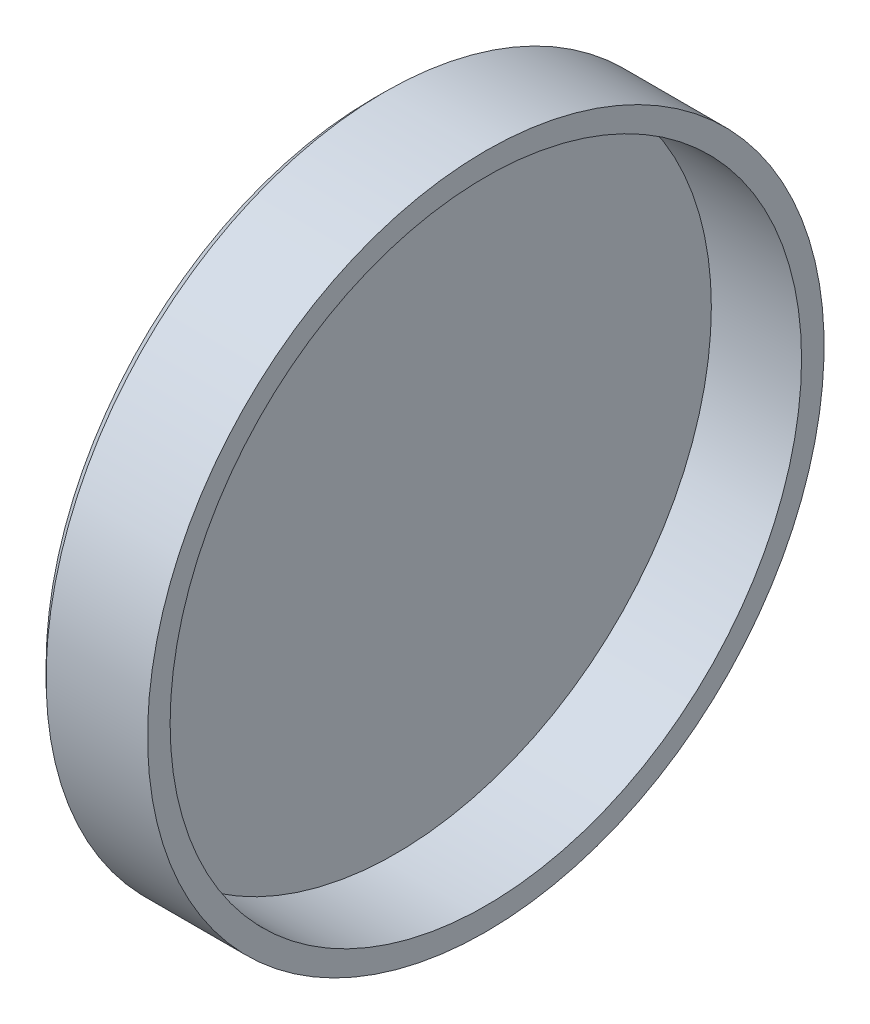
ISO-10303-21;
HEADER;
FILE_DESCRIPTION(('STEP AP214'),'2;1');
FILE_NAME('part.step','',(''),(''),'','','');
FILE_SCHEMA(('AUTOMOTIVE_DESIGN { 1 0 10303 214 1 1 1 1 }'));
ENDSEC;
DATA;
#1=APPLICATION_CONTEXT('core data for automotive mechanical design processes');
#2=APPLICATION_PROTOCOL_DEFINITION('international standard','automotive_design',2000,#1);
#3=PRODUCT_CONTEXT('',#1,'mechanical');
#4=PRODUCT('Part','Part','',(#3));
#5=PRODUCT_RELATED_PRODUCT_CATEGORY('part','',(#4));
#6=PRODUCT_DEFINITION_FORMATION('','',#4);
#7=PRODUCT_DEFINITION_CONTEXT('part definition',#1,'design');
#8=PRODUCT_DEFINITION('design','',#6,#7);
#9=PRODUCT_DEFINITION_SHAPE('','',#8);
#10=(LENGTH_UNIT() NAMED_UNIT(*) SI_UNIT(.MILLI.,.METRE.));
#11=(NAMED_UNIT(*) PLANE_ANGLE_UNIT() SI_UNIT($,.RADIAN.));
#12=(NAMED_UNIT(*) SI_UNIT($,.STERADIAN.) SOLID_ANGLE_UNIT());
#13=UNCERTAINTY_MEASURE_WITH_UNIT(LENGTH_MEASURE(1.E-05),#10,'distance_accuracy_value','');
#14=(GEOMETRIC_REPRESENTATION_CONTEXT(3) GLOBAL_UNCERTAINTY_ASSIGNED_CONTEXT((#13)) GLOBAL_UNIT_ASSIGNED_CONTEXT((#10,
#11,#12)) REPRESENTATION_CONTEXT('',''));
#15=CARTESIAN_POINT('',(0.,0.,0.));
#16=DIRECTION('',(0.,0.,1.));
#17=DIRECTION('',(1.,0.,0.));
#18=AXIS2_PLACEMENT_3D('',#15,#16,#17);
#19=CARTESIAN_POINT('',(1.,7.,0.));
#20=DIRECTION('',(1.,0.,0.));
#21=DIRECTION('',(0.,0.,-1.));
#22=AXIS2_PLACEMENT_3D('',#19,#20,#21);
#23=PLANE('',#22);
#24=CARTESIAN_POINT('',(1.,0.,0.));
#25=DIRECTION('',(1.,0.,0.));
#26=DIRECTION('',(0.,0.,-1.));
#27=AXIS2_PLACEMENT_3D('',#24,#25,#26);
#28=CIRCLE('',#27,14.);
#29=CARTESIAN_POINT('',(1.,0.,-14.));
#30=VERTEX_POINT('',#29);
#31=EDGE_CURVE('E18',#30,#30,#28,.F.);
#32=ORIENTED_EDGE('',*,*,#31,.F.);
#33=EDGE_LOOP('',(#32));
#34=FACE_BOUND('',#33,.T.);
#35=ADVANCED_FACE('F14',(#34),#23,.T.);
#36=CARTESIAN_POINT('',(1.,0.,0.));
#37=DIRECTION('',(1.,0.,0.));
#38=DIRECTION('',(0.,0.,-1.));
#39=AXIS2_PLACEMENT_3D('',#36,#37,#38);
#40=CYLINDRICAL_SURFACE('',#39,14.);
#41=ORIENTED_EDGE('',*,*,#31,.T.);
#42=EDGE_LOOP('',(#41));
#43=FACE_BOUND('',#42,.T.);
#44=CARTESIAN_POINT('',(5.,0.,0.));
#45=DIRECTION('',(1.,0.,0.));
#46=DIRECTION('',(0.,0.,-1.));
#47=AXIS2_PLACEMENT_3D('',#44,#45,#46);
#48=CIRCLE('',#47,14.);
#49=CARTESIAN_POINT('',(5.,0.,-14.));
#50=VERTEX_POINT('',#49);
#51=EDGE_CURVE('E31',#50,#50,#48,.F.);
#52=ORIENTED_EDGE('',*,*,#51,.F.);
#53=EDGE_LOOP('',(#52));
#54=FACE_BOUND('',#53,.T.);
#55=ADVANCED_FACE('F38',(#43,#54),#40,.F.);
#56=CARTESIAN_POINT('',(5.,14.5,0.));
#57=DIRECTION('',(1.,0.,0.));
#58=DIRECTION('',(0.,0.,-1.));
#59=AXIS2_PLACEMENT_3D('',#56,#57,#58);
#60=PLANE('',#59);
#61=CARTESIAN_POINT('',(5.,0.,0.));
#62=DIRECTION('',(1.,0.,0.));
#63=DIRECTION('',(0.,1.,0.));
#64=AXIS2_PLACEMENT_3D('',#61,#62,#63);
#65=CIRCLE('',#64,15.);
#66=CARTESIAN_POINT('',(5.,15.,0.));
#67=VERTEX_POINT('',#66);
#68=EDGE_CURVE('E27',#67,#67,#65,.F.);
#69=ORIENTED_EDGE('',*,*,#68,.F.);
#70=EDGE_LOOP('',(#69));
#71=FACE_BOUND('',#70,.T.);
#72=ORIENTED_EDGE('',*,*,#51,.T.);
#73=EDGE_LOOP('',(#72));
#74=FACE_BOUND('',#73,.T.);
#75=ADVANCED_FACE('F46',(#71,#74),#60,.T.);
#76=CARTESIAN_POINT('',(2.5,0.,0.));
#77=DIRECTION('',(1.,0.,0.));
#78=DIRECTION('',(0.,1.,0.));
#79=AXIS2_PLACEMENT_3D('',#76,#77,#78);
#80=CYLINDRICAL_SURFACE('',#79,15.);
#81=ORIENTED_EDGE('',*,*,#68,.T.);
#82=EDGE_LOOP('',(#81));
#83=FACE_BOUND('',#82,.T.);
#84=CARTESIAN_POINT('',(0.499999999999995,0.,0.));
#85=DIRECTION('',(1.,0.,0.));
#86=DIRECTION('',(0.,-1.,0.));
#87=AXIS2_PLACEMENT_3D('',#84,#85,#86);
#88=CIRCLE('',#87,15.);
#89=CARTESIAN_POINT('',(0.499999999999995,-15.,0.));
#90=VERTEX_POINT('',#89);
#91=EDGE_CURVE('E22',#90,#90,#88,.F.);
#92=ORIENTED_EDGE('',*,*,#91,.F.);
#93=EDGE_LOOP('',(#92));
#94=FACE_BOUND('',#93,.T.);
#95=ADVANCED_FACE('F52',(#83,#94),#80,.T.);
#96=CARTESIAN_POINT('',(0.499999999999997,0.,0.));
#97=DIRECTION('',(1.,0.,0.));
#98=DIRECTION('',(0.,0.,-1.));
#99=AXIS2_PLACEMENT_3D('',#96,#97,#98);
#100=CONICAL_SURFACE('',#99,15.,0.785398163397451);
#101=CARTESIAN_POINT('',(0.,0.,0.));
#102=DIRECTION('',(1.,0.,0.));
#103=DIRECTION('',(0.,0.,-1.));
#104=AXIS2_PLACEMENT_3D('',#101,#102,#103);
#105=CIRCLE('',#104,14.5);
#106=CARTESIAN_POINT('',(0.,0.,-14.5));
#107=VERTEX_POINT('',#106);
#108=EDGE_CURVE('E9',#107,#107,#105,.F.);
#109=ORIENTED_EDGE('',*,*,#108,.F.);
#110=EDGE_LOOP('',(#109));
#111=FACE_BOUND('',#110,.T.);
#112=ORIENTED_EDGE('',*,*,#91,.T.);
#113=EDGE_LOOP('',(#112));
#114=FACE_BOUND('',#113,.T.);
#115=ADVANCED_FACE('F49',(#111,#114),#100,.T.);
#116=CARTESIAN_POINT('',(0.,7.5,0.));
#117=DIRECTION('',(-1.,0.,0.));
#118=DIRECTION('',(0.,-1.,0.));
#119=AXIS2_PLACEMENT_3D('',#116,#117,#118);
#120=PLANE('',#119);
#121=ORIENTED_EDGE('',*,*,#108,.T.);
#122=EDGE_LOOP('',(#121));
#123=FACE_BOUND('',#122,.T.);
#124=ADVANCED_FACE('F16',(#123),#120,.T.);
#125=CLOSED_SHELL('',(#35,#55,#75,#95,#115,#124));
#126=MANIFOLD_SOLID_BREP('B1',#125);
#127=ADVANCED_BREP_SHAPE_REPRESENTATION('',(#18,#126),#14);
#128=SHAPE_DEFINITION_REPRESENTATION(#9,#127);
ENDSEC;
END-ISO-10303-21;
